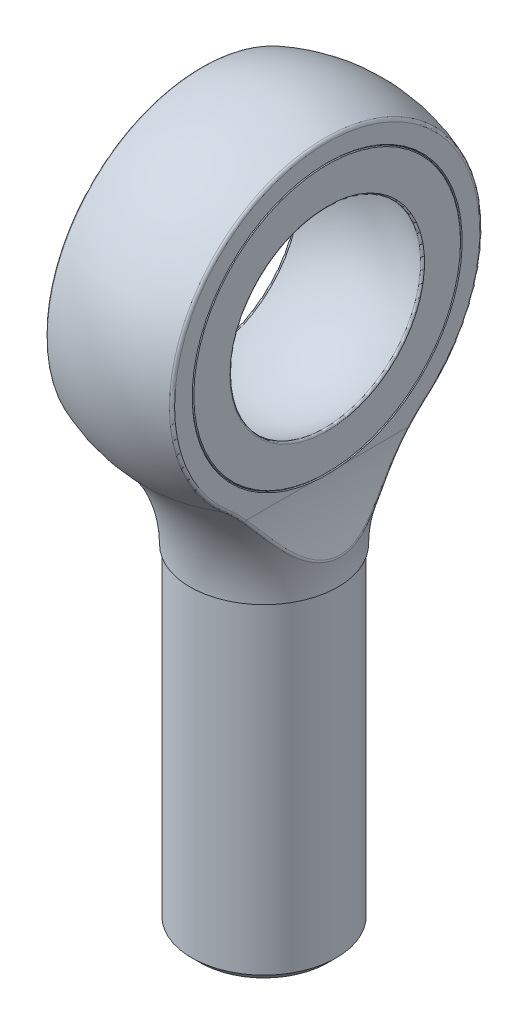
from build123d import *

# Parameters (mm, degrees)
CHAMFER1_SIZE           = 0.127
FILLET1_R               = 0.254
CUT_EXTRUDE1_DEPTH      = 94.121185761
CUT_EXTRUDE2_DEPTH      = 91.268492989
CUT_EXTRUDE2_DEPTH_BACK = 91.268492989
SKETCH4_R               = 20.6375
CHAMFER2_SIZE           = 0.127
CHAMFER3_SIZE           = 1.27
FILLET2_R               = 0.508


with BuildPart() as part:
    # Sketch1 → Revolve1 (revolve)
    with BuildSketch(Plane.XY, mode=Mode.PRIVATE) as revolve1_sk:
        with BuildLine():
            Line((0, 20.6375), (9.7155, 20.6375))
            Line((9.7155, 20.6375), (9.7155, 14.510271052))
            ThreePointArc((9.7155, 14.510271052), (5.077070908, 16.708149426), (0, 17.4625))
            Line((0, 17.4625), (0, 20.6375))
        make_face()
    revolve(revolve1_sk.sketch.rotate(Axis((0, 0, 0), (1, 0, 0)), 90), axis=Axis((0, 0, 0), (1, 0, 0)))

    # Chamfer1
    chamfer1_edges = [part.edges().sort_by_distance(p)[0] for p in [
        (9.7155, 0, -20.6375),
    ]]
    chamfer(chamfer1_edges, length=CHAMFER1_SIZE)

    # Fillet1
    fillet1_edges = [part.edges().sort_by_distance(p)[0] for p in [
        (9.7155, 0, -14.510271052),
    ]]
    fillet(fillet1_edges, radius=FILLET1_R)

    # Mirror1: part across plane


with BuildPart() as part_1:
    add(part.part)
    add(part.part.mirror(Plane(origin=(0, 0, 0), x_dir=(0, 0, 1), z_dir=(1, 0, 0))))


with BuildPart() as body_2:
    # Sketch2 → Revolve2 (revolve)
    with BuildSketch(Plane.XY, mode=Mode.PRIVATE) as revolve2_sk:
        with BuildLine():
            Line((0, 25.7175), (0, -85.725))
            Line((0, -85.725), (11.1125, -85.725))
            Line((11.1125, -85.725), (11.1125, -34.925))
            Line((11.1125, -34.925), (11.3665, -34.925))
            ThreePointArc((11.3665, -34.925), (13.164185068, -25.8202615), (18.287431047, -18.082026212))
            ThreePointArc((18.287431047, -18.082026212), (23.731985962, 9.908715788), (0, 25.7175))
        make_face()
    revolve(revolve2_sk.sketch.rotate(Axis((0, 0, 0), (0, 1, 0)), 90), axis=Axis((0, 0, 0), (0, 1, 0)))

    # Sketch3 → Cut-Extrude1 (cut, symmetric)
    with BuildSketch(Plane.XY):
        with BuildLine():
            Line((9.7155, 356.888126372), (9.7155, 55.5625))
            Line((9.7155, 55.5625), (9.7155, -20.6375))
            ThreePointArc((9.7155, -20.6375), (17.154987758, -38.598012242), (35.1155, -46.0375))
            Line((35.1155, -46.0375), (336.441126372, -46.0375))
            Line((336.441126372, -46.0375), (804.537371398, 333.533886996))
            Line((804.537371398, 333.533886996), (477.811745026, 736.459513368))
            Line((477.811745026, 736.459513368), (9.7155, 356.888126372))
        make_face()
    cut_extrude1 = extrude(amount=CUT_EXTRUDE1_DEPTH, both=True, mode=Mode.SUBTRACT)

    # Mirror2: Cut-Extrude1 across plane
    add(cut_extrude1.mirror(Plane(origin=(0, 0, 0), x_dir=(0, 0, 1), z_dir=(1, 0, 0))), mode=Mode.SUBTRACT)

    # Sketch4 → Cut-Extrude2 (cut, two sides: drawn at the far end of the back side and taken through both)
    with BuildSketch(Plane(origin=(0, 0, 0), x_dir=(0, 0, -1), z_dir=(1, 0, 0)).offset(-CUT_EXTRUDE2_DEPTH_BACK)):
        with Locations(Location((0, 0, 0), (0, 0, 270))):
            Circle(SKETCH4_R)
    extrude(amount=CUT_EXTRUDE2_DEPTH + CUT_EXTRUDE2_DEPTH_BACK, mode=Mode.SUBTRACT)

    # Chamfer2
    chamfer2_edges = [body_2.edges().sort_by_distance(p)[0] for p in [
        (9.7155, 20.6375, 0),
    ]]
    chamfer(chamfer2_edges, length=CHAMFER2_SIZE)

    # Chamfer3
    chamfer3_edges = [body_2.edges().sort_by_distance(p)[0] for p in [
        (0, -85.725, 11.1125),
    ]]
    chamfer(chamfer3_edges, length=CHAMFER3_SIZE)

    # Fillet2
    fillet2_edges = [body_2.edges().sort_by_distance(p)[0] for p in [
        (-9.7155, -19.322458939, 14.125896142),
        (0, -59.69, -11.1125),
        (-11.757354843, -30.615328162, 0),
        (0, -59.69, -11.1125),
        (9.7155, -19.322458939, 14.125896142),
        (11.757354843, -30.615328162, 0),
        (-9.7155, 23.811737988, 0),
        (9.7155, 23.811737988, 0),
    ]]
    fillet(fillet2_edges, radius=FILLET2_R)


solid = Compound([part_1.part, body_2.part])
